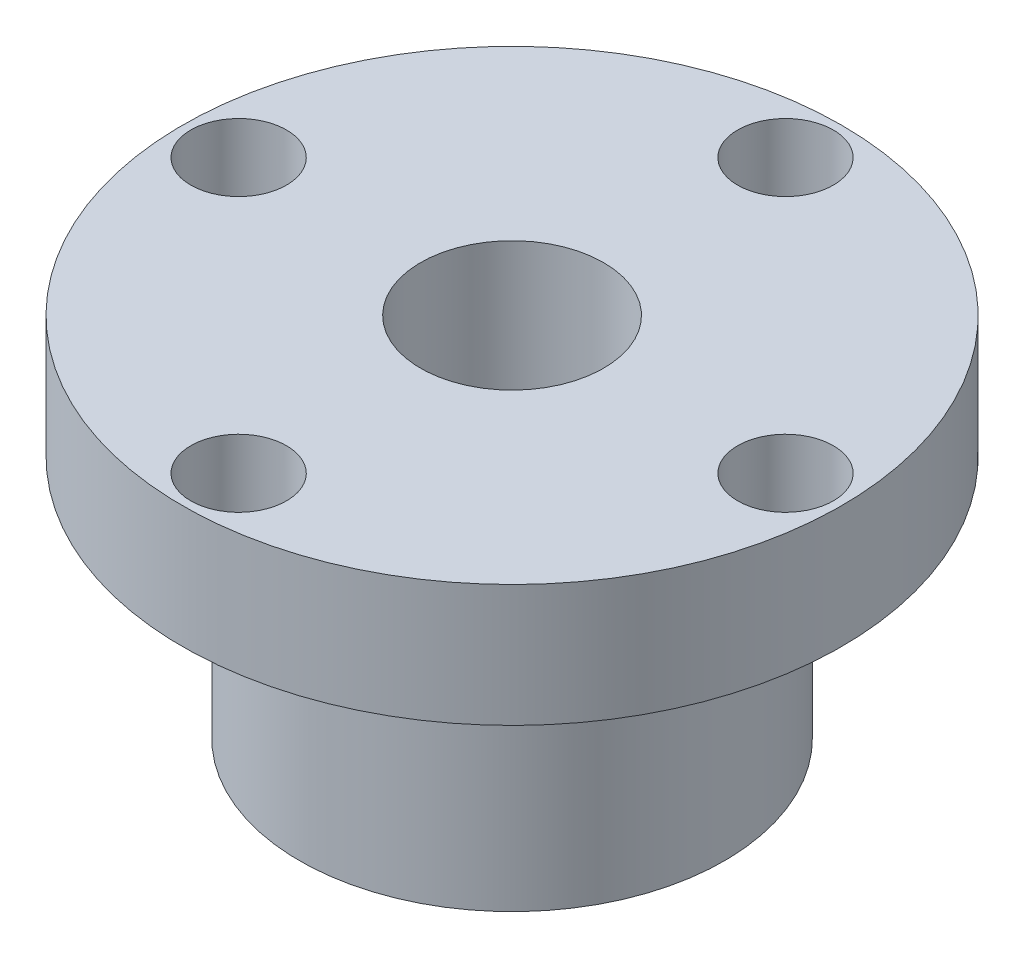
from build123d import *

# Parameters (mm, degrees)
SKETCH1_R                  = 17.145
SKETCH1_R_2                = 4.7625
EXTRUDE1_DEPTH             = 19.05
SKETCH5_R                  = 22.094928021
SKETCH5_R_2                = 11.049
CUT_EXTRUDE2_DEPTH         = 12.7
F_9_0_196_DIAMETER_HOLE1_D = 4.9784
CIRPATTERN1_COUNT          = 4


with BuildPart() as part:
    # Sketch1 → Extrude1 (new body)
    with BuildSketch(Plane(origin=(0, 0, 0), x_dir=(1, 0, 0), z_dir=(0, 1, 0))):
        with Locations(Location((0, 0, 0), (0, 0, 90))):
            Circle(SKETCH1_R)
        with Locations(Location((0, 0, 0), (0, 0, 90))):
            Circle(SKETCH1_R_2, mode=Mode.SUBTRACT)
    extrude(amount=EXTRUDE1_DEPTH)

    # Sketch5 → Cut-Extrude2 (cut)
    with BuildSketch(Plane.XZ):
        Circle(SKETCH5_R)
        with Locations(Location((0, 0, 0), (0, 0, 270))):
            Circle(SKETCH5_R_2, mode=Mode.SUBTRACT)
    extrude(amount=-CUT_EXTRUDE2_DEPTH, mode=Mode.SUBTRACT)

    # 9 _0.196_ Diameter Hole1 (through all)
    with Locations(Plane(origin=(14.224, 19.05, 0), x_dir=(0, 0, 1), z_dir=(0, 1, 0))):
        with Locations((0, 0)):
            f_9_0_196_diameter_hole1 = Hole(F_9_0_196_DIAMETER_HOLE1_D / 2)

    # CirPattern1: 9 _0.196_ Diameter Hole1 ×4 about axis
    cirpattern1_axis = Axis((0, 0, 0), (0, 1, 0))
    for i in range(1, CIRPATTERN1_COUNT):
        add(f_9_0_196_diameter_hole1.rotate(cirpattern1_axis, i * 360 / CIRPATTERN1_COUNT), mode=Mode.SUBTRACT)


solid = part.part
